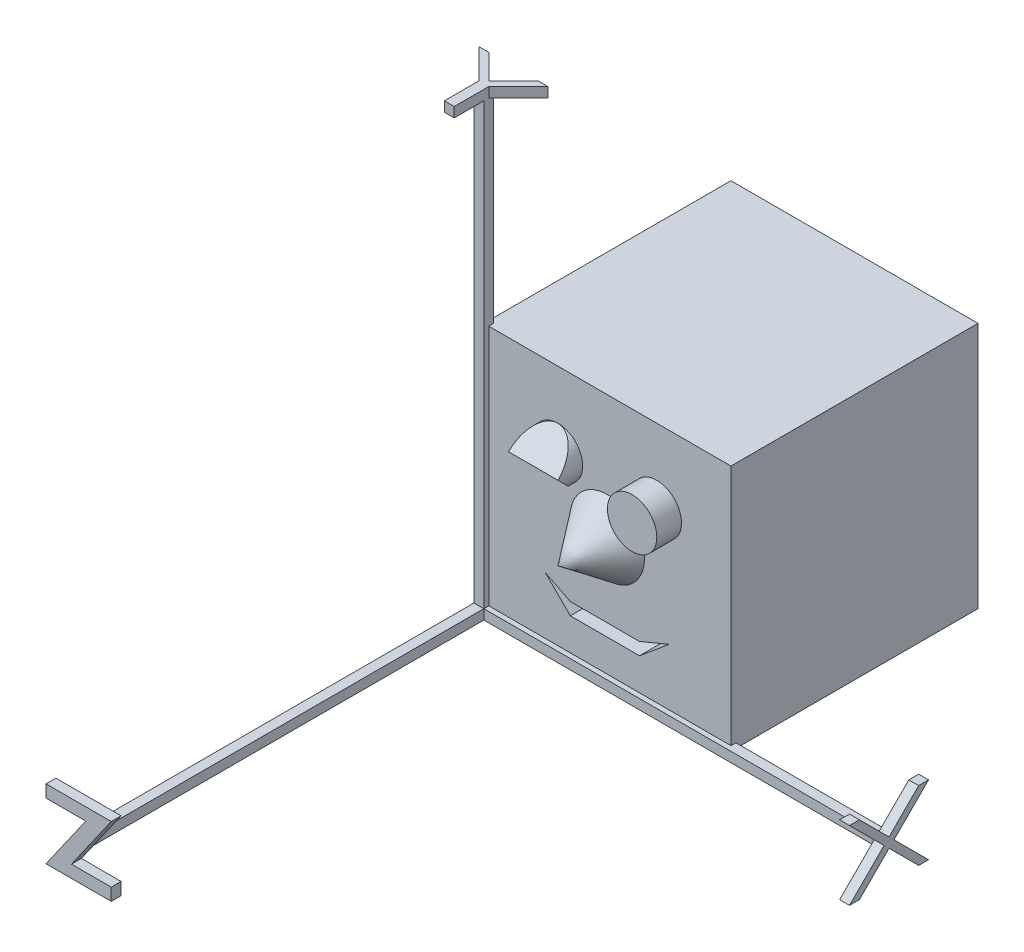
from build123d import *
from build123d.topology import SkipClean

# Parameters (mm, degrees)
SKETCH1_W          = 25
SKETCH1_H          = 25
EXTRUDE1_DEPTH     = 25
SKETCH2_R          = 2.5
EXTRUDE2_DEPTH     = 10
CUT_EXTRUDE1_DEPTH = 44.301270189
SKETCH4_R          = 2.5
EXTRUDE3_DEPTH     = 2.5
CUT_EXTRUDE2_DEPTH = 2.5
SKETCH14_W         = 1
SKETCH14_H         = 1
EXTRUDE4_DEPTH     = 45
EXTRUDE5_DEPTH     = 1
SKETCH17_W         = 1
SKETCH17_H         = 1
EXTRUDE6_DEPTH     = 40
EXTRUDE7_DEPTH     = 1
SKETCH19_W         = 1
SKETCH19_H         = 1
EXTRUDE8_DEPTH     = 40
EXTRUDE9_DEPTH     = 1


with BuildPart() as part:
    # Sketch1 → Extrude1 (new body)
    with BuildSketch(Plane.XY):
        with Locations((12.5, 12.5)):
            Rectangle(SKETCH1_W, SKETCH1_H)
    extrude(amount=-EXTRUDE1_DEPTH)

    # Sketch2 → Extrude2 (add)
    with BuildSketch(Plane.XY):
        with Locations(Location((7.5, 17.5, 0), (0, 0, 180))):
            Circle(SKETCH2_R)
    extrude(amount=EXTRUDE2_DEPTH)

    # Sketch3 → Cut-Extrude1 (cut, through all)
    with SkipClean():  # the faces are left unmerged after this step: merging them gives an invalid solid
        with BuildSketch(Plane.ZY):
            Polygon((0, 20), (12, 20), (12, 15), (0, 15), (2.5, 17.5), align=None)
        extrude(amount=-CUT_EXTRUDE1_DEPTH, mode=Mode.SUBTRACT)

    # Sketch4 → Extrude3 (add)
    with SkipClean():  # the faces are left unmerged after this step: merging them gives an invalid solid
        with BuildSketch(Plane.XY):
            with Locations(Location((17.5, 17.5, 0), (0, 0, 180))):
                Circle(SKETCH4_R)
        extrude(amount=EXTRUDE3_DEPTH)

    # Sketch10 → Cut-Extrude2 (cut)
    with SkipClean():  # the faces are left unmerged after this step: merging them gives an invalid solid
        with BuildSketch(Plane.XY):
            Polygon((6.25, 6.25), (8.75, 5), (15.75, 5), (18.75, 6.25), (15.75, 3.75), (8.75, 3.75), align=None)
        extrude(amount=-CUT_EXTRUDE2_DEPTH, mode=Mode.SUBTRACT)

    # Sketch13 → Revolve1 (revolve)
    with SkipClean():  # the faces are left unmerged after this step: merging them gives an invalid solid
        with BuildSketch(Plane(origin=(12.5, 0, 0), x_dir=(0, 0, -1), z_dir=(1, 0, 0)), mode=Mode.PRIVATE) as revolve1_sk:
            Polygon((0, 12.5), (-5, 12.5), (0, 16.25), align=None)
        revolve(revolve1_sk.sketch.rotate(Axis((12.5, 12.5, 0), (0, 0, 1)), 90), axis=Axis((12.5, 12.5, 0), (0, 0, 1)))

    # Sketch14 → Extrude4 (add)
    with SkipClean():  # the faces are left unmerged after this step: merging them gives an invalid solid
        with BuildSketch(Plane.XZ):
            Rectangle(SKETCH14_W, SKETCH14_H)
        extrude(amount=-EXTRUDE4_DEPTH)

    # Sketch16 → Extrude5 (add)
    with SkipClean():  # the faces are left unmerged after this step: merging them gives an invalid solid
        with BuildSketch(Plane(origin=(0, 45, 0), x_dir=(-1, 0, 0), z_dir=(0, 1, 0))):
            Polygon((0.5, 3.5), (0.5, 0), (3.5, -3), (2.5, -3), (0, -0.5), (-2.5, -3), (-3.5, -3), (-0.5, 0), (-0.5, 3.5), align=None)
        extrude(amount=EXTRUDE5_DEPTH)

    # Sketch17 → Extrude6 (add)
    with SkipClean():  # the faces are left unmerged after this step: merging them gives an invalid solid
        with BuildSketch(Plane.XY):
            Rectangle(SKETCH17_W, SKETCH17_H)
        extrude(amount=EXTRUDE6_DEPTH)

    # Sketch18 → Extrude7 (add)
    with SkipClean():  # the faces are left unmerged after this step: merging them gives an invalid solid
        with BuildSketch(Plane.XY.offset(40)):
            Polygon((-0.5, 0.5), (0.725363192, 2.25), (-3.300830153, 2.25), (-3.300830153, 3.5), (3.300830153, 3.5), (0.5, -0.5), (-0.725363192, -2.25), (3.300830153, -2.25), (3.300830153, -3.5), (-3.300830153, -3.5), align=None)
        extrude(amount=EXTRUDE7_DEPTH)

    # Sketch19 → Extrude8 (add)
    with SkipClean():  # the faces are left unmerged after this step: merging them gives an invalid solid
        with BuildSketch(Plane.ZY):
            Rectangle(SKETCH19_W, SKETCH19_H)
        extrude(amount=-EXTRUDE8_DEPTH)

    # Sketch20 → Extrude9 (add)
    with SkipClean():  # the faces are left unmerged after this step: merging them gives an invalid solid
        with BuildSketch(Plane(origin=(40, 0, 0), x_dir=(0, 0, -1), z_dir=(1, 0, 0))):
            Polygon((0, 0.5), (3, 3.5), (4, 3.5), (0.5, 0), (4, -3.5), (3, -3.5), (0, -0.5), (-3, -3.5), (-4, -3.5), (-0.5, 0), (-4, 3.5), (-3, 3.5), align=None)
        extrude(amount=EXTRUDE9_DEPTH)


solid = part.part
